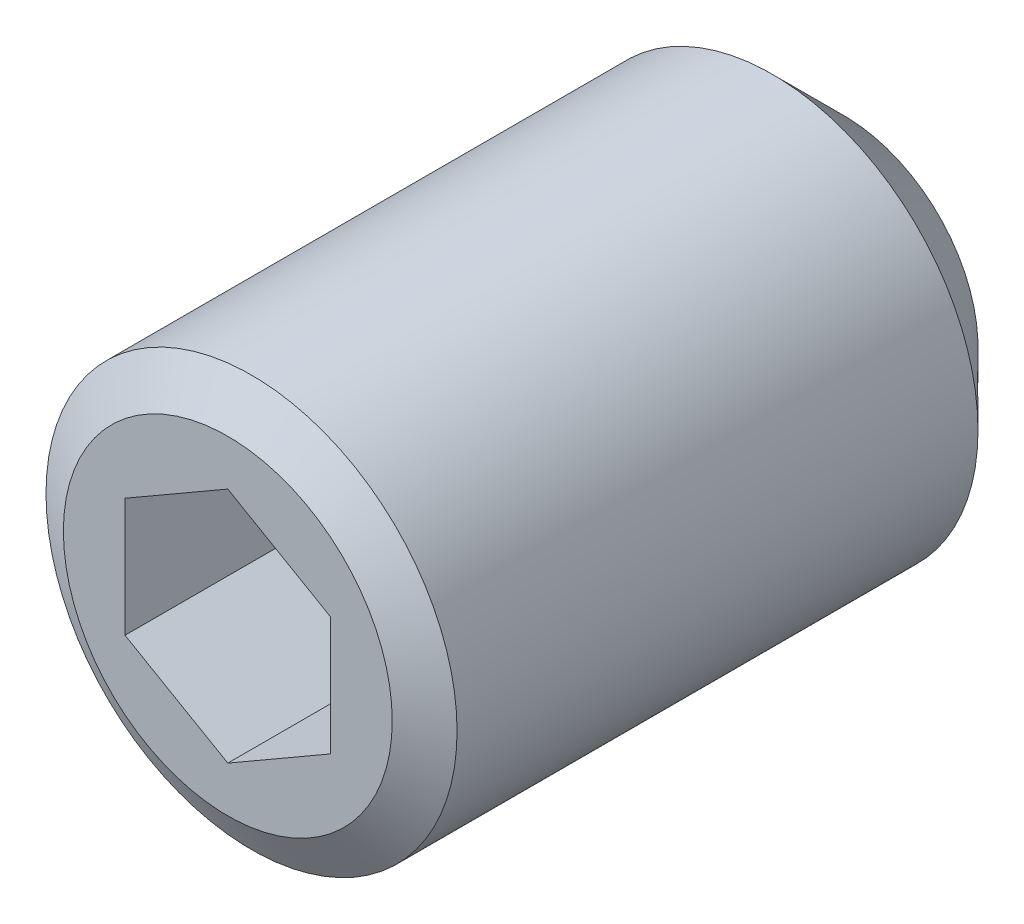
ISO-10303-21;
HEADER;
FILE_DESCRIPTION(('STEP AP214'),'2;1');
FILE_NAME('part.step','',(''),(''),'','','');
FILE_SCHEMA(('AUTOMOTIVE_DESIGN { 1 0 10303 214 1 1 1 1 }'));
ENDSEC;
DATA;
#1=APPLICATION_CONTEXT('core data for automotive mechanical design processes');
#2=APPLICATION_PROTOCOL_DEFINITION('international standard','automotive_design',2000,#1);
#3=PRODUCT_CONTEXT('',#1,'mechanical');
#4=PRODUCT('Part','Part','',(#3));
#5=PRODUCT_RELATED_PRODUCT_CATEGORY('part','',(#4));
#6=PRODUCT_DEFINITION_FORMATION('','',#4);
#7=PRODUCT_DEFINITION_CONTEXT('part definition',#1,'design');
#8=PRODUCT_DEFINITION('design','',#6,#7);
#9=PRODUCT_DEFINITION_SHAPE('','',#8);
#10=(LENGTH_UNIT() NAMED_UNIT(*) SI_UNIT(.MILLI.,.METRE.));
#11=(NAMED_UNIT(*) PLANE_ANGLE_UNIT() SI_UNIT($,.RADIAN.));
#12=(NAMED_UNIT(*) SI_UNIT($,.STERADIAN.) SOLID_ANGLE_UNIT());
#13=UNCERTAINTY_MEASURE_WITH_UNIT(LENGTH_MEASURE(1.E-05),#10,'distance_accuracy_value','');
#14=(GEOMETRIC_REPRESENTATION_CONTEXT(3) GLOBAL_UNCERTAINTY_ASSIGNED_CONTEXT((#13)) GLOBAL_UNIT_ASSIGNED_CONTEXT((#10,
#11,#12)) REPRESENTATION_CONTEXT('',''));
#15=CARTESIAN_POINT('',(0.,0.,0.));
#16=DIRECTION('',(0.,0.,1.));
#17=DIRECTION('',(1.,0.,0.));
#18=AXIS2_PLACEMENT_3D('',#15,#16,#17);
#19=CARTESIAN_POINT('',(0.,0.,6.));
#20=DIRECTION('',(0.,0.,1.));
#21=DIRECTION('',(1.,0.,0.));
#22=AXIS2_PLACEMENT_3D('',#19,#20,#21);
#23=PLANE('',#22);
#24=DIRECTION('',(0.866025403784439,-0.5,0.));
#25=VECTOR('',#24,1.);
#26=CARTESIAN_POINT('',(-1.,-0.577350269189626,6.));
#27=LINE('',#26,#25);
#28=CARTESIAN_POINT('',(-1.,-0.577350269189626,6.));
#29=VERTEX_POINT('',#28);
#30=CARTESIAN_POINT('',(0.,-1.15470053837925,6.));
#31=VERTEX_POINT('',#30);
#32=EDGE_CURVE('E29',#29,#31,#27,.T.);
#33=ORIENTED_EDGE('',*,*,#32,.F.);
#34=DIRECTION('',(0.,-1.,0.));
#35=VECTOR('',#34,1.);
#36=CARTESIAN_POINT('',(-1.,0.577350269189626,6.));
#37=LINE('',#36,#35);
#38=CARTESIAN_POINT('',(-1.,0.577350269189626,6.));
#39=VERTEX_POINT('',#38);
#40=EDGE_CURVE('E112',#39,#29,#37,.T.);
#41=ORIENTED_EDGE('',*,*,#40,.F.);
#42=DIRECTION('',(-0.866025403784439,-0.5,0.));
#43=VECTOR('',#42,1.);
#44=CARTESIAN_POINT('',(0.,1.15470053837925,6.));
#45=LINE('',#44,#43);
#46=CARTESIAN_POINT('',(0.,1.15470053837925,6.));
#47=VERTEX_POINT('',#46);
#48=EDGE_CURVE('E110',#47,#39,#45,.T.);
#49=ORIENTED_EDGE('',*,*,#48,.F.);
#50=DIRECTION('',(-0.866025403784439,0.5,0.));
#51=VECTOR('',#50,1.);
#52=CARTESIAN_POINT('',(1.,0.577350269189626,6.));
#53=LINE('',#52,#51);
#54=CARTESIAN_POINT('',(1.,0.577350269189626,6.));
#55=VERTEX_POINT('',#54);
#56=EDGE_CURVE('E77',#55,#47,#53,.T.);
#57=ORIENTED_EDGE('',*,*,#56,.F.);
#58=DIRECTION('',(0.,1.,0.));
#59=VECTOR('',#58,1.);
#60=CARTESIAN_POINT('',(1.,-0.577350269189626,6.));
#61=LINE('',#60,#59);
#62=CARTESIAN_POINT('',(1.,-0.577350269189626,6.));
#63=VERTEX_POINT('',#62);
#64=EDGE_CURVE('E106',#63,#55,#61,.T.);
#65=ORIENTED_EDGE('',*,*,#64,.F.);
#66=DIRECTION('',(0.866025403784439,0.5,0.));
#67=VECTOR('',#66,1.);
#68=CARTESIAN_POINT('',(0.,-1.15470053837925,6.));
#69=LINE('',#68,#67);
#70=EDGE_CURVE('E103',#31,#63,#69,.T.);
#71=ORIENTED_EDGE('',*,*,#70,.F.);
#72=EDGE_LOOP('',(#33,#41,#49,#57,#65,#71));
#73=FACE_BOUND('',#72,.T.);
#74=CARTESIAN_POINT('',(0.,0.,6.));
#75=DIRECTION('',(0.,0.,1.));
#76=DIRECTION('',(1.,0.,0.));
#77=AXIS2_PLACEMENT_3D('',#74,#75,#76);
#78=CIRCLE('',#77,1.6);
#79=CARTESIAN_POINT('',(1.6,0.,6.));
#80=VERTEX_POINT('',#79);
#81=EDGE_CURVE('E9',#80,#80,#78,.T.);
#82=ORIENTED_EDGE('',*,*,#81,.T.);
#83=EDGE_LOOP('',(#82));
#84=FACE_BOUND('',#83,.T.);
#85=ADVANCED_FACE('F14',(#73,#84),#23,.T.);
#86=CARTESIAN_POINT('',(0.,0.,-14.2247720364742));
#87=DIRECTION('',(0.,0.,-1.));
#88=DIRECTION('',(-1.,0.,0.));
#89=AXIS2_PLACEMENT_3D('',#86,#87,#88);
#90=CYLINDRICAL_SURFACE('',#89,2.);
#91=CARTESIAN_POINT('',(0.,0.,5.76905989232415));
#92=DIRECTION('',(0.,0.,1.));
#93=DIRECTION('',(1.,0.,0.));
#94=AXIS2_PLACEMENT_3D('',#91,#92,#93);
#95=CIRCLE('',#94,2.);
#96=CARTESIAN_POINT('',(2.,0.,5.76905989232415));
#97=VERTEX_POINT('',#96);
#98=EDGE_CURVE('E22',#97,#97,#95,.F.);
#99=ORIENTED_EDGE('',*,*,#98,.T.);
#100=EDGE_LOOP('',(#99));
#101=FACE_BOUND('',#100,.T.);
#102=CARTESIAN_POINT('',(0.,0.,0.7));
#103=DIRECTION('',(0.,0.,-1.));
#104=DIRECTION('',(-1.,0.,0.));
#105=AXIS2_PLACEMENT_3D('',#102,#103,#104);
#106=CIRCLE('',#105,2.);
#107=CARTESIAN_POINT('',(-2.,0.,0.7));
#108=VERTEX_POINT('',#107);
#109=EDGE_CURVE('E124',#108,#108,#106,.F.);
#110=ORIENTED_EDGE('',*,*,#109,.T.);
#111=EDGE_LOOP('',(#110));
#112=FACE_BOUND('',#111,.T.);
#113=ADVANCED_FACE('F129',(#101,#112),#90,.T.);
#114=CARTESIAN_POINT('',(0.,0.,0.));
#115=DIRECTION('',(0.,0.,-1.));
#116=DIRECTION('',(-1.,0.,0.));
#117=AXIS2_PLACEMENT_3D('',#114,#115,#116);
#118=PLANE('',#117);
#119=CARTESIAN_POINT('',(0.,0.,0.));
#120=DIRECTION('',(0.,0.,-1.));
#121=DIRECTION('',(-1.,0.,0.));
#122=AXIS2_PLACEMENT_3D('',#119,#120,#121);
#123=CIRCLE('',#122,1.3);
#124=CARTESIAN_POINT('',(-1.3,0.,0.));
#125=VERTEX_POINT('',#124);
#126=EDGE_CURVE('E116',#125,#125,#123,.T.);
#127=ORIENTED_EDGE('',*,*,#126,.T.);
#128=EDGE_LOOP('',(#127));
#129=FACE_BOUND('',#128,.T.);
#130=ADVANCED_FACE('F144',(#129),#118,.T.);
#131=CARTESIAN_POINT('',(0.,0.,0.));
#132=DIRECTION('',(0.,0.,1.));
#133=DIRECTION('',(1.,0.,0.));
#134=AXIS2_PLACEMENT_3D('',#131,#132,#133);
#135=CONICAL_SURFACE('',#134,1.3,0.785398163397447);
#136=ORIENTED_EDGE('',*,*,#109,.F.);
#137=EDGE_LOOP('',(#136));
#138=FACE_BOUND('',#137,.T.);
#139=ORIENTED_EDGE('',*,*,#126,.F.);
#140=EDGE_LOOP('',(#139));
#141=FACE_BOUND('',#140,.T.);
#142=ADVANCED_FACE('F134',(#138,#141),#135,.T.);
#143=CARTESIAN_POINT('',(0.,0.,5.76905989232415));
#144=DIRECTION('',(0.,0.,-1.));
#145=DIRECTION('',(-1.,0.,0.));
#146=AXIS2_PLACEMENT_3D('',#143,#144,#145);
#147=CONICAL_SURFACE('',#146,2.,1.04719755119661);
#148=ORIENTED_EDGE('',*,*,#81,.F.);
#149=EDGE_LOOP('',(#148));
#150=FACE_BOUND('',#149,.T.);
#151=ORIENTED_EDGE('',*,*,#98,.F.);
#152=EDGE_LOOP('',(#151));
#153=FACE_BOUND('',#152,.T.);
#154=ADVANCED_FACE('F16',(#150,#153),#147,.T.);
#155=CARTESIAN_POINT('',(-1.,-0.577350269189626,3.5));
#156=DIRECTION('',(-0.5,-0.866025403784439,0.));
#157=DIRECTION('',(-0.866025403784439,0.5,0.));
#158=AXIS2_PLACEMENT_3D('',#155,#156,#157);
#159=PLANE('',#158);
#160=ORIENTED_EDGE('',*,*,#32,.T.);
#161=DIRECTION('',(0.,0.,1.));
#162=VECTOR('',#161,1.);
#163=CARTESIAN_POINT('',(0.,-1.15470053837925,3.5));
#164=LINE('',#163,#162);
#165=CARTESIAN_POINT('',(0.,-1.15470053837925,3.5));
#166=VERTEX_POINT('',#165);
#167=EDGE_CURVE('E59',#166,#31,#164,.T.);
#168=ORIENTED_EDGE('',*,*,#167,.F.);
#169=DIRECTION('',(0.866025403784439,-0.5,0.));
#170=VECTOR('',#169,1.);
#171=CARTESIAN_POINT('',(-1.,-0.577350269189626,3.5));
#172=LINE('',#171,#170);
#173=CARTESIAN_POINT('',(-1.,-0.577350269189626,3.5));
#174=VERTEX_POINT('',#173);
#175=EDGE_CURVE('E114',#174,#166,#172,.T.);
#176=ORIENTED_EDGE('',*,*,#175,.F.);
#177=DIRECTION('',(0.,0.,1.));
#178=VECTOR('',#177,1.);
#179=CARTESIAN_POINT('',(-1.,-0.577350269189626,3.5));
#180=LINE('',#179,#178);
#181=EDGE_CURVE('E37',#174,#29,#180,.T.);
#182=ORIENTED_EDGE('',*,*,#181,.T.);
#183=EDGE_LOOP('',(#160,#168,#176,#182));
#184=FACE_BOUND('',#183,.T.);
#185=ADVANCED_FACE('F133',(#184),#159,.F.);
#186=CARTESIAN_POINT('',(-1.,0.577350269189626,3.5));
#187=DIRECTION('',(-1.,0.,0.));
#188=DIRECTION('',(0.,0.,1.));
#189=AXIS2_PLACEMENT_3D('',#186,#187,#188);
#190=PLANE('',#189);
#191=ORIENTED_EDGE('',*,*,#40,.T.);
#192=ORIENTED_EDGE('',*,*,#181,.F.);
#193=DIRECTION('',(0.,-1.,0.));
#194=VECTOR('',#193,1.);
#195=CARTESIAN_POINT('',(-1.,0.577350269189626,3.5));
#196=LINE('',#195,#194);
#197=CARTESIAN_POINT('',(-1.,0.577350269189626,3.5));
#198=VERTEX_POINT('',#197);
#199=EDGE_CURVE('E89',#198,#174,#196,.T.);
#200=ORIENTED_EDGE('',*,*,#199,.F.);
#201=DIRECTION('',(0.,0.,1.));
#202=VECTOR('',#201,1.);
#203=CARTESIAN_POINT('',(-1.,0.577350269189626,3.5));
#204=LINE('',#203,#202);
#205=EDGE_CURVE('E81',#198,#39,#204,.T.);
#206=ORIENTED_EDGE('',*,*,#205,.T.);
#207=EDGE_LOOP('',(#191,#192,#200,#206));
#208=FACE_BOUND('',#207,.T.);
#209=ADVANCED_FACE('F142',(#208),#190,.F.);
#210=CARTESIAN_POINT('',(0.,1.15470053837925,3.5));
#211=DIRECTION('',(-0.5,0.866025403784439,0.));
#212=DIRECTION('',(0.866025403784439,0.5,0.));
#213=AXIS2_PLACEMENT_3D('',#210,#211,#212);
#214=PLANE('',#213);
#215=ORIENTED_EDGE('',*,*,#48,.T.);
#216=ORIENTED_EDGE('',*,*,#205,.F.);
#217=DIRECTION('',(-0.866025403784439,-0.5,0.));
#218=VECTOR('',#217,1.);
#219=CARTESIAN_POINT('',(0.,1.15470053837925,3.5));
#220=LINE('',#219,#218);
#221=CARTESIAN_POINT('',(0.,1.15470053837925,3.5));
#222=VERTEX_POINT('',#221);
#223=EDGE_CURVE('E85',#222,#198,#220,.T.);
#224=ORIENTED_EDGE('',*,*,#223,.F.);
#225=DIRECTION('',(0.,0.,1.));
#226=VECTOR('',#225,1.);
#227=CARTESIAN_POINT('',(0.,1.15470053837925,3.5));
#228=LINE('',#227,#226);
#229=EDGE_CURVE('E70',#222,#47,#228,.T.);
#230=ORIENTED_EDGE('',*,*,#229,.T.);
#231=EDGE_LOOP('',(#215,#216,#224,#230));
#232=FACE_BOUND('',#231,.T.);
#233=ADVANCED_FACE('F86',(#232),#214,.F.);
#234=CARTESIAN_POINT('',(1.,0.577350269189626,3.5));
#235=DIRECTION('',(0.5,0.866025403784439,0.));
#236=DIRECTION('',(0.866025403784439,-0.5,0.));
#237=AXIS2_PLACEMENT_3D('',#234,#235,#236);
#238=PLANE('',#237);
#239=ORIENTED_EDGE('',*,*,#56,.T.);
#240=ORIENTED_EDGE('',*,*,#229,.F.);
#241=DIRECTION('',(-0.866025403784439,0.5,0.));
#242=VECTOR('',#241,1.);
#243=CARTESIAN_POINT('',(1.,0.577350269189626,3.5));
#244=LINE('',#243,#242);
#245=CARTESIAN_POINT('',(1.,0.577350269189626,3.5));
#246=VERTEX_POINT('',#245);
#247=EDGE_CURVE('E74',#246,#222,#244,.T.);
#248=ORIENTED_EDGE('',*,*,#247,.F.);
#249=DIRECTION('',(0.,0.,1.));
#250=VECTOR('',#249,1.);
#251=CARTESIAN_POINT('',(1.,0.577350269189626,3.5));
#252=LINE('',#251,#250);
#253=EDGE_CURVE('E82',#246,#55,#252,.T.);
#254=ORIENTED_EDGE('',*,*,#253,.T.);
#255=EDGE_LOOP('',(#239,#240,#248,#254));
#256=FACE_BOUND('',#255,.T.);
#257=ADVANCED_FACE('F72',(#256),#238,.F.);
#258=CARTESIAN_POINT('',(1.,-0.577350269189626,3.5));
#259=DIRECTION('',(1.,0.,0.));
#260=DIRECTION('',(0.,0.,-1.));
#261=AXIS2_PLACEMENT_3D('',#258,#259,#260);
#262=PLANE('',#261);
#263=ORIENTED_EDGE('',*,*,#64,.T.);
#264=ORIENTED_EDGE('',*,*,#253,.F.);
#265=DIRECTION('',(0.,1.,0.));
#266=VECTOR('',#265,1.);
#267=CARTESIAN_POINT('',(1.,-0.577350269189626,3.5));
#268=LINE('',#267,#266);
#269=CARTESIAN_POINT('',(1.,-0.577350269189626,3.5));
#270=VERTEX_POINT('',#269);
#271=EDGE_CURVE('E95',#270,#246,#268,.T.);
#272=ORIENTED_EDGE('',*,*,#271,.F.);
#273=DIRECTION('',(0.,0.,1.));
#274=VECTOR('',#273,1.);
#275=CARTESIAN_POINT('',(1.,-0.577350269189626,3.5));
#276=LINE('',#275,#274);
#277=EDGE_CURVE('E119',#270,#63,#276,.T.);
#278=ORIENTED_EDGE('',*,*,#277,.T.);
#279=EDGE_LOOP('',(#263,#264,#272,#278));
#280=FACE_BOUND('',#279,.T.);
#281=ADVANCED_FACE('F163',(#280),#262,.F.);
#282=CARTESIAN_POINT('',(0.,-1.15470053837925,3.5));
#283=DIRECTION('',(0.5,-0.866025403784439,0.));
#284=DIRECTION('',(-0.866025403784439,-0.5,0.));
#285=AXIS2_PLACEMENT_3D('',#282,#283,#284);
#286=PLANE('',#285);
#287=ORIENTED_EDGE('',*,*,#70,.T.);
#288=ORIENTED_EDGE('',*,*,#277,.F.);
#289=DIRECTION('',(0.866025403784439,0.5,0.));
#290=VECTOR('',#289,1.);
#291=CARTESIAN_POINT('',(0.,-1.15470053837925,3.5));
#292=LINE('',#291,#290);
#293=EDGE_CURVE('E97',#166,#270,#292,.T.);
#294=ORIENTED_EDGE('',*,*,#293,.F.);
#295=ORIENTED_EDGE('',*,*,#167,.T.);
#296=EDGE_LOOP('',(#287,#288,#294,#295));
#297=FACE_BOUND('',#296,.T.);
#298=ADVANCED_FACE('F160',(#297),#286,.F.);
#299=CARTESIAN_POINT('',(0.,-1.15470053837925,3.5));
#300=DIRECTION('',(0.,0.,1.));
#301=DIRECTION('',(1.,0.,0.));
#302=AXIS2_PLACEMENT_3D('',#299,#300,#301);
#303=PLANE('',#302);
#304=ORIENTED_EDGE('',*,*,#175,.T.);
#305=ORIENTED_EDGE('',*,*,#293,.T.);
#306=ORIENTED_EDGE('',*,*,#271,.T.);
#307=ORIENTED_EDGE('',*,*,#247,.T.);
#308=ORIENTED_EDGE('',*,*,#223,.T.);
#309=ORIENTED_EDGE('',*,*,#199,.T.);
#310=EDGE_LOOP('',(#304,#305,#306,#307,#308,#309));
#311=FACE_BOUND('',#310,.T.);
#312=ADVANCED_FACE('F92',(#311),#303,.T.);
#313=CLOSED_SHELL('',(#85,#113,#130,#142,#154,#185,#209,#233,#257,#281,#298,#312));
#314=MANIFOLD_SOLID_BREP('B1',#313);
#315=ADVANCED_BREP_SHAPE_REPRESENTATION('',(#18,#314),#14);
#316=SHAPE_DEFINITION_REPRESENTATION(#9,#315);
ENDSEC;
END-ISO-10303-21;
